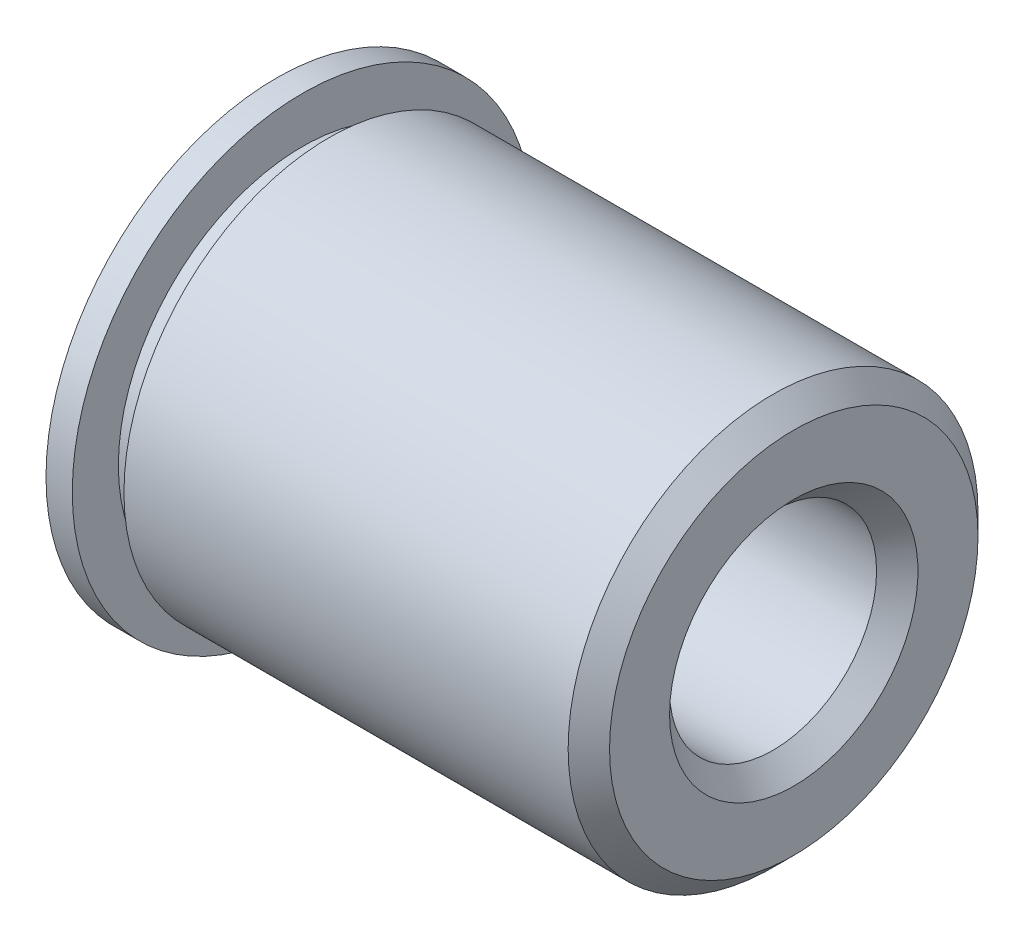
ISO-10303-21;
HEADER;
FILE_DESCRIPTION(('STEP AP214'),'2;1');
FILE_NAME('part.step','',(''),(''),'','','');
FILE_SCHEMA(('AUTOMOTIVE_DESIGN { 1 0 10303 214 1 1 1 1 }'));
ENDSEC;
DATA;
#1=APPLICATION_CONTEXT('core data for automotive mechanical design processes');
#2=APPLICATION_PROTOCOL_DEFINITION('international standard','automotive_design',2000,#1);
#3=PRODUCT_CONTEXT('',#1,'mechanical');
#4=PRODUCT('Part','Part','',(#3));
#5=PRODUCT_RELATED_PRODUCT_CATEGORY('part','',(#4));
#6=PRODUCT_DEFINITION_FORMATION('','',#4);
#7=PRODUCT_DEFINITION_CONTEXT('part definition',#1,'design');
#8=PRODUCT_DEFINITION('design','',#6,#7);
#9=PRODUCT_DEFINITION_SHAPE('','',#8);
#10=(LENGTH_UNIT() NAMED_UNIT(*) SI_UNIT(.MILLI.,.METRE.));
#11=(NAMED_UNIT(*) PLANE_ANGLE_UNIT() SI_UNIT($,.RADIAN.));
#12=(NAMED_UNIT(*) SI_UNIT($,.STERADIAN.) SOLID_ANGLE_UNIT());
#13=UNCERTAINTY_MEASURE_WITH_UNIT(LENGTH_MEASURE(1.E-05),#10,'distance_accuracy_value','');
#14=(GEOMETRIC_REPRESENTATION_CONTEXT(3) GLOBAL_UNCERTAINTY_ASSIGNED_CONTEXT((#13)) GLOBAL_UNIT_ASSIGNED_CONTEXT((#10,
#11,#12)) REPRESENTATION_CONTEXT('',''));
#15=CARTESIAN_POINT('',(0.,0.,0.));
#16=DIRECTION('',(0.,0.,1.));
#17=DIRECTION('',(1.,0.,0.));
#18=AXIS2_PLACEMENT_3D('',#15,#16,#17);
#19=CARTESIAN_POINT('',(74.2136725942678,0.,0.));
#20=DIRECTION('',(-1.,0.,0.));
#21=DIRECTION('',(0.,0.,1.));
#22=AXIS2_PLACEMENT_3D('',#19,#20,#21);
#23=PLANE('',#22);
#24=CARTESIAN_POINT('',(74.2136725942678,0.,0.));
#25=DIRECTION('',(-1.,0.,0.));
#26=DIRECTION('',(0.,0.,1.));
#27=AXIS2_PLACEMENT_3D('',#24,#25,#26);
#28=CIRCLE('',#27,1.2);
#29=CARTESIAN_POINT('',(74.2136725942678,0.,1.2));
#30=VERTEX_POINT('',#29);
#31=EDGE_CURVE('E10',#30,#30,#28,.T.);
#32=ORIENTED_EDGE('',*,*,#31,.T.);
#33=EDGE_LOOP('',(#32));
#34=FACE_BOUND('',#33,.T.);
#35=CARTESIAN_POINT('',(74.2136725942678,0.,0.));
#36=DIRECTION('',(-1.,0.,0.));
#37=DIRECTION('',(0.,0.,1.));
#38=AXIS2_PLACEMENT_3D('',#35,#36,#37);
#39=CIRCLE('',#38,1.77999999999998);
#40=CARTESIAN_POINT('',(74.2136725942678,0.,1.77999999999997));
#41=VERTEX_POINT('',#40);
#42=EDGE_CURVE('E55',#41,#41,#39,.F.);
#43=ORIENTED_EDGE('',*,*,#42,.T.);
#44=EDGE_LOOP('',(#43));
#45=FACE_BOUND('',#44,.T.);
#46=ADVANCED_FACE('F35',(#34,#45),#23,.F.);
#47=CARTESIAN_POINT('',(-67.8249023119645,0.,0.));
#48=DIRECTION('',(-1.,0.,0.));
#49=DIRECTION('',(0.,0.,1.));
#50=AXIS2_PLACEMENT_3D('',#47,#48,#49);
#51=CYLINDRICAL_SURFACE('',#50,1.98);
#52=CARTESIAN_POINT('',(74.0136725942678,0.,0.));
#53=DIRECTION('',(-1.,0.,0.));
#54=DIRECTION('',(0.,0.,1.));
#55=AXIS2_PLACEMENT_3D('',#52,#53,#54);
#56=CIRCLE('',#55,1.98);
#57=CARTESIAN_POINT('',(74.0136725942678,0.,1.97999999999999));
#58=VERTEX_POINT('',#57);
#59=EDGE_CURVE('E58',#58,#58,#56,.T.);
#60=ORIENTED_EDGE('',*,*,#59,.T.);
#61=EDGE_LOOP('',(#60));
#62=FACE_BOUND('',#61,.T.);
#63=CARTESIAN_POINT('',(69.7216725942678,0.,0.));
#64=DIRECTION('',(-1.,0.,0.));
#65=DIRECTION('',(0.,0.,1.));
#66=AXIS2_PLACEMENT_3D('',#63,#64,#65);
#67=CIRCLE('',#66,1.98);
#68=CARTESIAN_POINT('',(69.7216725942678,0.,1.98));
#69=VERTEX_POINT('',#68);
#70=EDGE_CURVE('E61',#69,#69,#67,.T.);
#71=ORIENTED_EDGE('',*,*,#70,.F.);
#72=EDGE_LOOP('',(#71));
#73=FACE_BOUND('',#72,.T.);
#74=ADVANCED_FACE('F100',(#62,#73),#51,.T.);
#75=CARTESIAN_POINT('',(69.7216725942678,1.98,0.));
#76=DIRECTION('',(1.,0.,0.));
#77=DIRECTION('',(0.,0.,-1.));
#78=AXIS2_PLACEMENT_3D('',#75,#76,#77);
#79=PLANE('',#78);
#80=CARTESIAN_POINT('',(69.7216725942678,0.,0.));
#81=DIRECTION('',(-1.,0.,0.));
#82=DIRECTION('',(0.,0.,1.));
#83=AXIS2_PLACEMENT_3D('',#80,#81,#82);
#84=CIRCLE('',#83,1.78);
#85=CARTESIAN_POINT('',(69.7216725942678,0.,1.78));
#86=VERTEX_POINT('',#85);
#87=EDGE_CURVE('E64',#86,#86,#84,.T.);
#88=ORIENTED_EDGE('',*,*,#87,.F.);
#89=EDGE_LOOP('',(#88));
#90=FACE_BOUND('',#89,.T.);
#91=ORIENTED_EDGE('',*,*,#70,.T.);
#92=EDGE_LOOP('',(#91));
#93=FACE_BOUND('',#92,.T.);
#94=ADVANCED_FACE('F94',(#90,#93),#79,.F.);
#95=CARTESIAN_POINT('',(-67.8249023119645,0.,0.));
#96=DIRECTION('',(-1.,0.,0.));
#97=DIRECTION('',(0.,0.,1.));
#98=AXIS2_PLACEMENT_3D('',#95,#96,#97);
#99=CYLINDRICAL_SURFACE('',#98,1.78);
#100=CARTESIAN_POINT('',(69.4676725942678,0.,0.));
#101=DIRECTION('',(-1.,0.,0.));
#102=DIRECTION('',(0.,0.,1.));
#103=AXIS2_PLACEMENT_3D('',#100,#101,#102);
#104=CIRCLE('',#103,1.78);
#105=CARTESIAN_POINT('',(69.4676725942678,0.,1.78));
#106=VERTEX_POINT('',#105);
#107=EDGE_CURVE('E67',#106,#106,#104,.T.);
#108=ORIENTED_EDGE('',*,*,#107,.F.);
#109=EDGE_LOOP('',(#108));
#110=FACE_BOUND('',#109,.T.);
#111=ORIENTED_EDGE('',*,*,#87,.T.);
#112=EDGE_LOOP('',(#111));
#113=FACE_BOUND('',#112,.T.);
#114=ADVANCED_FACE('F88',(#110,#113),#99,.T.);
#115=CARTESIAN_POINT('',(69.4676725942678,1.78,0.));
#116=DIRECTION('',(-1.,0.,0.));
#117=DIRECTION('',(0.,0.,1.));
#118=AXIS2_PLACEMENT_3D('',#115,#116,#117);
#119=PLANE('',#118);
#120=CARTESIAN_POINT('',(69.4676725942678,0.,0.));
#121=DIRECTION('',(-1.,0.,0.));
#122=DIRECTION('',(0.,0.,1.));
#123=AXIS2_PLACEMENT_3D('',#120,#121,#122);
#124=CIRCLE('',#123,2.225);
#125=CARTESIAN_POINT('',(69.4676725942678,0.,2.225));
#126=VERTEX_POINT('',#125);
#127=EDGE_CURVE('E70',#126,#126,#124,.T.);
#128=ORIENTED_EDGE('',*,*,#127,.F.);
#129=EDGE_LOOP('',(#128));
#130=FACE_BOUND('',#129,.T.);
#131=ORIENTED_EDGE('',*,*,#107,.T.);
#132=EDGE_LOOP('',(#131));
#133=FACE_BOUND('',#132,.T.);
#134=ADVANCED_FACE('F82',(#130,#133),#119,.F.);
#135=CARTESIAN_POINT('',(-67.8249023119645,0.,0.));
#136=DIRECTION('',(-1.,0.,0.));
#137=DIRECTION('',(0.,0.,1.));
#138=AXIS2_PLACEMENT_3D('',#135,#136,#137);
#139=CYLINDRICAL_SURFACE('',#138,2.225);
#140=CARTESIAN_POINT('',(69.2136725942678,0.,0.));
#141=DIRECTION('',(-1.,0.,0.));
#142=DIRECTION('',(0.,0.,1.));
#143=AXIS2_PLACEMENT_3D('',#140,#141,#142);
#144=CIRCLE('',#143,2.225);
#145=CARTESIAN_POINT('',(69.2136725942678,0.,2.225));
#146=VERTEX_POINT('',#145);
#147=EDGE_CURVE('E73',#146,#146,#144,.T.);
#148=ORIENTED_EDGE('',*,*,#147,.F.);
#149=EDGE_LOOP('',(#148));
#150=FACE_BOUND('',#149,.T.);
#151=ORIENTED_EDGE('',*,*,#127,.T.);
#152=EDGE_LOOP('',(#151));
#153=FACE_BOUND('',#152,.T.);
#154=ADVANCED_FACE('F79',(#150,#153),#139,.T.);
#155=CARTESIAN_POINT('',(69.2136725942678,2.225,0.));
#156=DIRECTION('',(1.,0.,0.));
#157=DIRECTION('',(0.,0.,-1.));
#158=AXIS2_PLACEMENT_3D('',#155,#156,#157);
#159=PLANE('',#158);
#160=CARTESIAN_POINT('',(69.2136725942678,0.,0.));
#161=DIRECTION('',(1.,0.,0.));
#162=DIRECTION('',(0.,0.,-1.));
#163=AXIS2_PLACEMENT_3D('',#160,#161,#162);
#164=CIRCLE('',#163,1.20000000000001);
#165=CARTESIAN_POINT('',(69.2136725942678,0.,-1.20000000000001));
#166=VERTEX_POINT('',#165);
#167=EDGE_CURVE('E50',#166,#166,#164,.T.);
#168=ORIENTED_EDGE('',*,*,#167,.T.);
#169=EDGE_LOOP('',(#168));
#170=FACE_BOUND('',#169,.T.);
#171=ORIENTED_EDGE('',*,*,#147,.T.);
#172=EDGE_LOOP('',(#171));
#173=FACE_BOUND('',#172,.T.);
#174=ADVANCED_FACE('F77',(#170,#173),#159,.F.);
#175=CARTESIAN_POINT('',(69.2136725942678,0.,0.));
#176=DIRECTION('',(1.,0.,0.));
#177=DIRECTION('',(0.,0.,-1.));
#178=AXIS2_PLACEMENT_3D('',#175,#176,#177);
#179=CYLINDRICAL_SURFACE('',#178,1.);
#180=CARTESIAN_POINT('',(69.4136725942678,0.,0.));
#181=DIRECTION('',(1.,0.,0.));
#182=DIRECTION('',(0.,0.,-1.));
#183=AXIS2_PLACEMENT_3D('',#180,#181,#182);
#184=CIRCLE('',#183,1.);
#185=CARTESIAN_POINT('',(69.4136725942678,0.,-1.));
#186=VERTEX_POINT('',#185);
#187=EDGE_CURVE('E42',#186,#186,#184,.F.);
#188=ORIENTED_EDGE('',*,*,#187,.T.);
#189=EDGE_LOOP('',(#188));
#190=FACE_BOUND('',#189,.T.);
#191=CARTESIAN_POINT('',(74.0136725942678,0.,0.));
#192=DIRECTION('',(-1.,0.,0.));
#193=DIRECTION('',(0.,0.,1.));
#194=AXIS2_PLACEMENT_3D('',#191,#192,#193);
#195=CIRCLE('',#194,1.);
#196=CARTESIAN_POINT('',(74.0136725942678,0.,1.));
#197=VERTEX_POINT('',#196);
#198=EDGE_CURVE('E46',#197,#197,#195,.F.);
#199=ORIENTED_EDGE('',*,*,#198,.T.);
#200=EDGE_LOOP('',(#199));
#201=FACE_BOUND('',#200,.T.);
#202=ADVANCED_FACE('F115',(#190,#201),#179,.F.);
#203=CARTESIAN_POINT('',(74.0136725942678,0.,0.));
#204=DIRECTION('',(-1.,0.,0.));
#205=DIRECTION('',(0.,0.,1.));
#206=AXIS2_PLACEMENT_3D('',#203,#204,#205);
#207=CONICAL_SURFACE('',#206,1.98,0.78539816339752);
#208=CARTESIAN_POINT('',(74.2136725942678,0.,1.77999999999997));
#209=CARTESIAN_POINT('',(74.2115892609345,0.,1.7820833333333));
#210=CARTESIAN_POINT('',(74.2095059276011,0.,1.78416666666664));
#211=CARTESIAN_POINT('',(74.2053392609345,0.,1.78833333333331));
#212=CARTESIAN_POINT('',(74.2032559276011,0.,1.79041666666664));
#213=CARTESIAN_POINT('',(74.1990892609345,0.,1.79458333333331));
#214=CARTESIAN_POINT('',(74.1970059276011,0.,1.79666666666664));
#215=CARTESIAN_POINT('',(74.1928392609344,0.,1.80083333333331));
#216=CARTESIAN_POINT('',(74.1907559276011,0.,1.80291666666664));
#217=CARTESIAN_POINT('',(74.1865892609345,0.,1.80708333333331));
#218=CARTESIAN_POINT('',(74.1845059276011,0.,1.80916666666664));
#219=CARTESIAN_POINT('',(74.1803392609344,0.,1.81333333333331));
#220=CARTESIAN_POINT('',(74.1782559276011,0.,1.81541666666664));
#221=CARTESIAN_POINT('',(74.1740892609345,0.,1.81958333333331));
#222=CARTESIAN_POINT('',(74.1720059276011,0.,1.82166666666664));
#223=CARTESIAN_POINT('',(74.1678392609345,0.,1.82583333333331));
#224=CARTESIAN_POINT('',(74.1657559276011,0.,1.82791666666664));
#225=CARTESIAN_POINT('',(74.1615892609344,0.,1.83208333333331));
#226=CARTESIAN_POINT('',(74.1595059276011,0.,1.83416666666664));
#227=CARTESIAN_POINT('',(74.1553392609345,0.,1.83833333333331));
#228=CARTESIAN_POINT('',(74.1532559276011,0.,1.84041666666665));
#229=CARTESIAN_POINT('',(74.1490892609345,0.,1.84458333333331));
#230=CARTESIAN_POINT('',(74.1470059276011,0.,1.84666666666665));
#231=CARTESIAN_POINT('',(74.1428392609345,0.,1.85083333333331));
#232=CARTESIAN_POINT('',(74.1407559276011,0.,1.85291666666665));
#233=CARTESIAN_POINT('',(74.1365892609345,0.,1.85708333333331));
#234=CARTESIAN_POINT('',(74.1345059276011,0.,1.85916666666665));
#235=CARTESIAN_POINT('',(74.1303392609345,0.,1.86333333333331));
#236=CARTESIAN_POINT('',(74.1282559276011,0.,1.86541666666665));
#237=CARTESIAN_POINT('',(74.1240892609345,0.,1.86958333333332));
#238=CARTESIAN_POINT('',(74.1220059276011,0.,1.87166666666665));
#239=CARTESIAN_POINT('',(74.1178392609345,0.,1.87583333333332));
#240=CARTESIAN_POINT('',(74.1157559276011,0.,1.87791666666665));
#241=CARTESIAN_POINT('',(74.1115892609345,0.,1.88208333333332));
#242=CARTESIAN_POINT('',(74.1095059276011,0.,1.88416666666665));
#243=CARTESIAN_POINT('',(74.1053392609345,0.,1.88833333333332));
#244=CARTESIAN_POINT('',(74.1032559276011,0.,1.89041666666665));
#245=CARTESIAN_POINT('',(74.0990892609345,0.,1.89458333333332));
#246=CARTESIAN_POINT('',(74.0970059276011,0.,1.89666666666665));
#247=CARTESIAN_POINT('',(74.0928392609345,0.,1.90083333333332));
#248=CARTESIAN_POINT('',(74.0907559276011,0.,1.90291666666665));
#249=CARTESIAN_POINT('',(74.0865892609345,0.,1.90708333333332));
#250=CARTESIAN_POINT('',(74.0845059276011,0.,1.90916666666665));
#251=CARTESIAN_POINT('',(74.0803392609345,0.,1.91333333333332));
#252=CARTESIAN_POINT('',(74.0782559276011,0.,1.91541666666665));
#253=CARTESIAN_POINT('',(74.0740892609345,0.,1.91958333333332));
#254=CARTESIAN_POINT('',(74.0720059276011,0.,1.92166666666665));
#255=CARTESIAN_POINT('',(74.0678392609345,0.,1.92583333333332));
#256=CARTESIAN_POINT('',(74.0657559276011,0.,1.92791666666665));
#257=CARTESIAN_POINT('',(74.0615892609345,0.,1.93208333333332));
#258=CARTESIAN_POINT('',(74.0595059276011,0.,1.93416666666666));
#259=CARTESIAN_POINT('',(74.0553392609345,0.,1.93833333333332));
#260=CARTESIAN_POINT('',(74.0532559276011,0.,1.94041666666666));
#261=CARTESIAN_POINT('',(74.0490892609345,0.,1.94458333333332));
#262=CARTESIAN_POINT('',(74.0470059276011,0.,1.94666666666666));
#263=CARTESIAN_POINT('',(74.0428392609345,0.,1.95083333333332));
#264=CARTESIAN_POINT('',(74.0407559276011,0.,1.95291666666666));
#265=CARTESIAN_POINT('',(74.0365892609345,0.,1.95708333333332));
#266=CARTESIAN_POINT('',(74.0345059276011,0.,1.95916666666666));
#267=CARTESIAN_POINT('',(74.0303392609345,0.,1.96333333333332));
#268=CARTESIAN_POINT('',(74.0282559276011,0.,1.96541666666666));
#269=CARTESIAN_POINT('',(74.0240892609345,0.,1.96958333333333));
#270=CARTESIAN_POINT('',(74.0220059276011,0.,1.97166666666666));
#271=CARTESIAN_POINT('',(74.0178392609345,0.,1.97583333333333));
#272=CARTESIAN_POINT('',(74.0157559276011,0.,1.97791666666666));
#273=CARTESIAN_POINT('',(74.0136725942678,0.,1.97999999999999));
#274=B_SPLINE_CURVE_WITH_KNOTS('',3,(#208,#209,#210,#211,#212,#213,#214,#215,#216,#217,#218,
#219,#220,#221,#222,#223,#224,#225,#226,#227,#228,#229,#230,#231,#232,#233,#234,#235,#236,#237,
#238,#239,#240,#241,#242,#243,#244,#245,#246,#247,#248,#249,#250,#251,#252,#253,#254,#255,#256,
#257,#258,#259,#260,#261,#262,#263,#264,#265,#266,#267,#268,#269,#270,#271,#272,#273),
.UNSPECIFIED.,.F.,.F.,(4,2,2,2,2,2,2,2,2,2,2,2,2,2,2,2,2,2,2,2,2,2,2,2,2,2,2,2,2,2,2,2,4),(0.,
0.0088388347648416,0.0176776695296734,0.0265165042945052,0.035355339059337,0.0441941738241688,
0.0530330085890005,0.0618718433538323,0.0707106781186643,0.0795495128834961,0.0883883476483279,
0.0972271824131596,0.106066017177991,0.114904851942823,0.123743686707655,0.132582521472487,
0.141421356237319,0.150260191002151,0.159099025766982,0.167937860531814,0.176776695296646,
0.185615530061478,0.19445436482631,0.203293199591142,0.212132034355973,0.220970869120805,
0.229809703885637,0.238648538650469,0.247487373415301,0.256326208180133,0.265165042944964,
0.274003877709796,0.282842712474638),.UNSPECIFIED.);
#275=EDGE_CURVE('BSEAM112',#41,#58,#274,.T.);
#276=ORIENTED_EDGE('',*,*,#42,.F.);
#277=ORIENTED_EDGE('',*,*,#59,.F.);
#278=ORIENTED_EDGE('',*,*,#275,.T.);
#279=ORIENTED_EDGE('',*,*,#275,.F.);
#280=EDGE_LOOP('',(#276,#278,#277,#279));
#281=FACE_BOUND('',#280,.T.);
#282=ADVANCED_FACE('F112',(#281),#207,.T.);
#283=CARTESIAN_POINT('',(69.2136725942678,0.,0.));
#284=DIRECTION('',(-1.,0.,0.));
#285=DIRECTION('',(0.,0.,1.));
#286=AXIS2_PLACEMENT_3D('',#283,#284,#285);
#287=CONICAL_SURFACE('',#286,1.20000000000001,0.785398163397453);
#288=ORIENTED_EDGE('',*,*,#187,.F.);
#289=EDGE_LOOP('',(#288));
#290=FACE_BOUND('',#289,.T.);
#291=ORIENTED_EDGE('',*,*,#167,.F.);
#292=EDGE_LOOP('',(#291));
#293=FACE_BOUND('',#292,.T.);
#294=ADVANCED_FACE('F114',(#290,#293),#287,.F.);
#295=CARTESIAN_POINT('',(74.0136725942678,0.,0.));
#296=DIRECTION('',(1.,0.,0.));
#297=DIRECTION('',(0.,0.,-1.));
#298=AXIS2_PLACEMENT_3D('',#295,#296,#297);
#299=CONICAL_SURFACE('',#298,1.,0.785398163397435);
#300=ORIENTED_EDGE('',*,*,#31,.F.);
#301=EDGE_LOOP('',(#300));
#302=FACE_BOUND('',#301,.T.);
#303=ORIENTED_EDGE('',*,*,#198,.F.);
#304=EDGE_LOOP('',(#303));
#305=FACE_BOUND('',#304,.T.);
#306=ADVANCED_FACE('F37',(#302,#305),#299,.F.);
#307=CLOSED_SHELL('',(#46,#74,#94,#114,#134,#154,#174,#202,#282,#294,#306));
#308=MANIFOLD_SOLID_BREP('B2',#307);
#309=ADVANCED_BREP_SHAPE_REPRESENTATION('',(#18,#308),#14);
#310=SHAPE_DEFINITION_REPRESENTATION(#9,#309);
ENDSEC;
END-ISO-10303-21;
